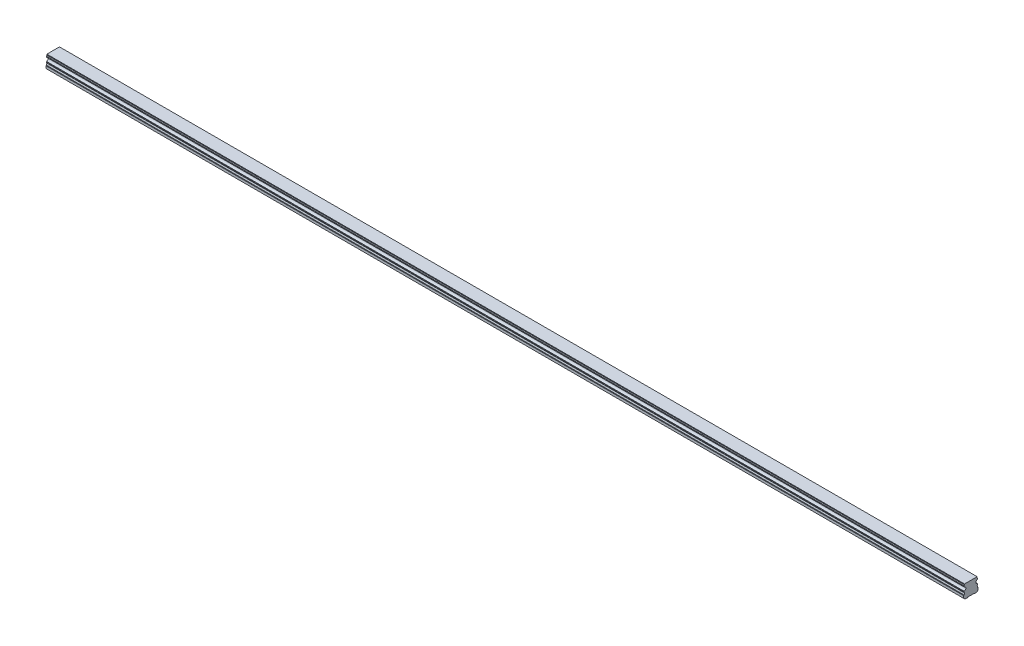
from build123d import *

# Parameters (mm, degrees)
BOSS_EXTRUDE1_DEPTH        = 960
SKETCH3_R                  = 2.5
SKETCH3_R_2                = 2.1
CUT_EXTRUDE3_DEPTH         = 7
SKETCH3_2_R                = 2.1
CUT_EXTRUDE4_DEPTH         = 9.5
CHAMFER1_SIZE              = 0.4
LPATTERN2_COUNT            = 16
LPATTERN2_PITCH            = 60
CHAMFER1_OF_LPATTERN2_SIZE = 0.4


with BuildPart() as part:
    # Sketch1 → Boss-Extrude1 (new body)
    with BuildSketch(Plane(origin=(0, 0, 0), x_dir=(0, 0, -1), z_dir=(1, 0, 0))):
        with BuildLine():
            Line((6.59, 14), (-6.59, 14))
            Line((-6.59, 14), (-6.59, 13.15))
            Line((-6.59, 13.15), (-6.96, 12.356532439))
            Line((-6.96, 12.356532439), (-6.96, 11.435174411))
            ThreePointArc((-6.96, 11.435174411), (-5.25, 9.5), (-6.96, 7.564825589))
            Line((-6.96, 7.564825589), (-6.96, 6.643467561))
            Line((-6.96, 6.643467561), (-6.59, 5.85))
            Line((-6.59, 5.85), (-7.032116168, 4.2))
            Line((-7.032116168, 4.2), (-7.5, 3.929867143))
            Line((-7.5, 3.929867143), (-7.5, 1.4))
            Line((-7.5, 1.4), (-6.1, 0))
            Line((-6.1, 0), (-3.65, 0))
            Line((-3.65, 0), (-3.25, 0.4))
            Line((-3.25, 0.4), (3.25, 0.4))
            Line((3.25, 0.4), (3.65, 0))
            Line((3.65, 0), (6.1, 0))
            Line((6.1, 0), (7.5, 1.4))
            Line((7.5, 1.4), (7.5, 3.929867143))
            Line((7.5, 3.929867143), (7.032116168, 4.2))
            Line((7.032116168, 4.2), (6.59, 5.85))
            Line((6.59, 5.85), (6.96, 6.643467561))
            Line((6.96, 6.643467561), (6.96, 7.564825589))
            ThreePointArc((6.96, 7.564825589), (5.25, 9.5), (6.96, 11.435174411))
            Line((6.96, 11.435174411), (6.96, 12.356532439))
            Line((6.96, 12.356532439), (6.59, 13.15))
            Line((6.59, 13.15), (6.59, 14))
        make_face()
    extrude(amount=BOSS_EXTRUDE1_DEPTH)

    # Sketch3 → Cut-Extrude3 (cut)
    with BuildSketch(Plane.XZ):
        with Locations(Location((30, 0, 0), (0, 0, 270))):
            Circle(SKETCH3_R)
        with Locations(Location((30, 0, 0), (0, 0, 270))):
            Circle(SKETCH3_R_2, mode=Mode.SUBTRACT)
    cut_extrude3 = extrude(amount=-CUT_EXTRUDE3_DEPTH, mode=Mode.SUBTRACT)

    # Sketch3_2 → Cut-Extrude4 (cut)
    with BuildSketch(Plane.XZ):
        with Locations(Location((30, 0, 0), (0, 0, 270))):
            Circle(SKETCH3_2_R)
    cut_extrude4 = extrude(amount=-CUT_EXTRUDE4_DEPTH, mode=Mode.SUBTRACT)

    # Cut-Extrude5 cone 1 section (on through the dimple's axis) → Cut-Extrude5 (revolve, cut)
    with BuildSketch(Plane(origin=(30, 9.5, 0), x_dir=(0, 0, -1), z_dir=(1, 0, 0))):
        Polygon((0, 0), (2.1, 0), (0, 1.212435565), align=None)
    revolve(axis=Axis((30, 9.5, 0), (0, 1, 0)), mode=Mode.SUBTRACT)

    # Chamfer1
    chamfer1_edges = [part.edges().sort_by_distance(p)[0] for p in [
        (30, 0.4, 2.5),
    ]]
    chamfer(chamfer1_edges, length=CHAMFER1_SIZE)

    # LPattern2: Cut-Extrude3, Cut-Extrude4 ×16
    with Locations(*[(i * LPATTERN2_PITCH, 0, 0) for i in range(1, LPATTERN2_COUNT)]):
        add(cut_extrude3, mode=Mode.SUBTRACT)
        add(cut_extrude4, mode=Mode.SUBTRACT)

    # Chamfer1 of LPattern2
    chamfer1_of_lpattern2_edges = [part.edges().sort_by_distance(p)[0] for p in [
        (90, 0.4, 2.5),
        (150, 0.4, 2.5),
        (210, 0.4, 2.5),
        (270, 0.4, 2.5),
        (330, 0.4, 2.5),
        (390, 0.4, 2.5),
        (450, 0.4, 2.5),
        (510, 0.4, 2.5),
        (570, 0.4, 2.5),
        (630, 0.4, 2.5),
        (690, 0.4, 2.5),
        (750, 0.4, 2.5),
        (810, 0.4, 2.5),
        (870, 0.4, 2.5),
        (930, 0.4, 2.5),
    ]]
    chamfer(chamfer1_of_lpattern2_edges, length=CHAMFER1_OF_LPATTERN2_SIZE)


solid = part.part
